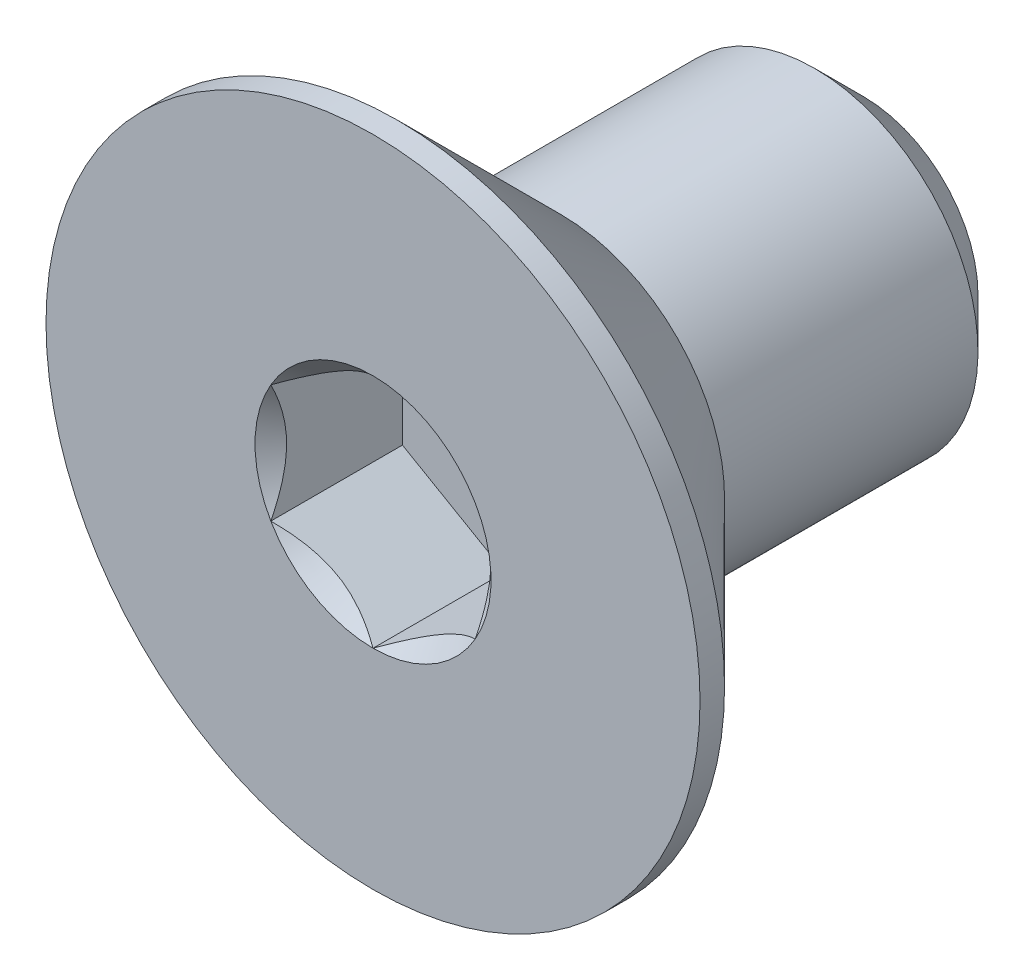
ISO-10303-21;
HEADER;
FILE_DESCRIPTION(('STEP AP214'),'2;1');
FILE_NAME('part.step','',(''),(''),'','','');
FILE_SCHEMA(('AUTOMOTIVE_DESIGN { 1 0 10303 214 1 1 1 1 }'));
ENDSEC;
DATA;
#1=APPLICATION_CONTEXT('core data for automotive mechanical design processes');
#2=APPLICATION_PROTOCOL_DEFINITION('international standard','automotive_design',2000,#1);
#3=PRODUCT_CONTEXT('',#1,'mechanical');
#4=PRODUCT('Part','Part','',(#3));
#5=PRODUCT_RELATED_PRODUCT_CATEGORY('part','',(#4));
#6=PRODUCT_DEFINITION_FORMATION('','',#4);
#7=PRODUCT_DEFINITION_CONTEXT('part definition',#1,'design');
#8=PRODUCT_DEFINITION('design','',#6,#7);
#9=PRODUCT_DEFINITION_SHAPE('','',#8);
#10=(LENGTH_UNIT() NAMED_UNIT(*) SI_UNIT(.MILLI.,.METRE.));
#11=(NAMED_UNIT(*) PLANE_ANGLE_UNIT() SI_UNIT($,.RADIAN.));
#12=(NAMED_UNIT(*) SI_UNIT($,.STERADIAN.) SOLID_ANGLE_UNIT());
#13=UNCERTAINTY_MEASURE_WITH_UNIT(LENGTH_MEASURE(1.E-05),#10,'distance_accuracy_value','');
#14=(GEOMETRIC_REPRESENTATION_CONTEXT(3) GLOBAL_UNCERTAINTY_ASSIGNED_CONTEXT((#13)) GLOBAL_UNIT_ASSIGNED_CONTEXT((#10,
#11,#12)) REPRESENTATION_CONTEXT('',''));
#15=CARTESIAN_POINT('',(0.,0.,0.));
#16=DIRECTION('',(0.,0.,1.));
#17=DIRECTION('',(1.,0.,0.));
#18=AXIS2_PLACEMENT_3D('',#15,#16,#17);
#19=CARTESIAN_POINT('',(0.,0.,-3.));
#20=DIRECTION('',(0.,0.,-1.));
#21=DIRECTION('',(0.,1.,0.));
#22=AXIS2_PLACEMENT_3D('',#19,#20,#21);
#23=CYLINDRICAL_SURFACE('',#22,2.);
#24=CARTESIAN_POINT('',(0.,0.,0.700000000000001));
#25=DIRECTION('',(0.,0.,-1.));
#26=DIRECTION('',(0.,1.,0.));
#27=AXIS2_PLACEMENT_3D('',#24,#25,#26);
#28=CIRCLE('',#27,2.);
#29=CARTESIAN_POINT('',(0.,2.,0.700000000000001));
#30=VERTEX_POINT('',#29);
#31=EDGE_CURVE('E11',#30,#30,#28,.F.);
#32=ORIENTED_EDGE('',*,*,#31,.F.);
#33=EDGE_LOOP('',(#32));
#34=FACE_BOUND('',#33,.T.);
#35=CARTESIAN_POINT('',(0.,0.,-2.4));
#36=DIRECTION('',(0.,0.,-1.));
#37=DIRECTION('',(0.,1.,0.));
#38=AXIS2_PLACEMENT_3D('',#35,#36,#37);
#39=CIRCLE('',#38,2.);
#40=CARTESIAN_POINT('',(0.,2.,-2.4));
#41=VERTEX_POINT('',#40);
#42=EDGE_CURVE('E41',#41,#41,#39,.F.);
#43=ORIENTED_EDGE('',*,*,#42,.T.);
#44=EDGE_LOOP('',(#43));
#45=FACE_BOUND('',#44,.T.);
#46=ADVANCED_FACE('F33',(#34,#45),#23,.T.);
#47=CARTESIAN_POINT('',(0.,2.,-3.));
#48=DIRECTION('',(0.,0.,-1.));
#49=DIRECTION('',(0.,1.,0.));
#50=AXIS2_PLACEMENT_3D('',#47,#48,#49);
#51=PLANE('',#50);
#52=CARTESIAN_POINT('',(0.,0.,-3.));
#53=DIRECTION('',(0.,0.,-1.));
#54=DIRECTION('',(0.,1.,0.));
#55=AXIS2_PLACEMENT_3D('',#52,#53,#54);
#56=CIRCLE('',#55,1.4);
#57=CARTESIAN_POINT('',(0.,1.4,-3.));
#58=VERTEX_POINT('',#57);
#59=EDGE_CURVE('E145',#58,#58,#56,.T.);
#60=ORIENTED_EDGE('',*,*,#59,.T.);
#61=EDGE_LOOP('',(#60));
#62=FACE_BOUND('',#61,.T.);
#63=ADVANCED_FACE('F154',(#62),#51,.T.);
#64=CARTESIAN_POINT('',(0.,0.,-3.));
#65=DIRECTION('',(0.,0.,1.));
#66=DIRECTION('',(0.,-1.,0.));
#67=AXIS2_PLACEMENT_3D('',#64,#65,#66);
#68=CONICAL_SURFACE('',#67,1.4,0.785398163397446);
#69=ORIENTED_EDGE('',*,*,#42,.F.);
#70=EDGE_LOOP('',(#69));
#71=FACE_BOUND('',#70,.T.);
#72=ORIENTED_EDGE('',*,*,#59,.F.);
#73=EDGE_LOOP('',(#72));
#74=FACE_BOUND('',#73,.T.);
#75=ADVANCED_FACE('F35',(#71,#74),#68,.T.);
#76=CARTESIAN_POINT('',(0.,0.,-3.));
#77=DIRECTION('',(0.,0.,-1.));
#78=DIRECTION('',(0.,1.,0.));
#79=AXIS2_PLACEMENT_3D('',#76,#77,#78);
#80=CYLINDRICAL_SURFACE('',#79,4.);
#81=CARTESIAN_POINT('',(0.,0.,3.));
#82=DIRECTION('',(0.,0.,-1.));
#83=DIRECTION('',(0.,1.,0.));
#84=AXIS2_PLACEMENT_3D('',#81,#82,#83);
#85=CIRCLE('',#84,4.);
#86=CARTESIAN_POINT('',(0.,4.,3.));
#87=VERTEX_POINT('',#86);
#88=EDGE_CURVE('E125',#87,#87,#85,.T.);
#89=ORIENTED_EDGE('',*,*,#88,.T.);
#90=EDGE_LOOP('',(#89));
#91=FACE_BOUND('',#90,.T.);
#92=CARTESIAN_POINT('',(0.,0.,2.69999999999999));
#93=DIRECTION('',(0.,0.,-1.));
#94=DIRECTION('',(0.,1.,0.));
#95=AXIS2_PLACEMENT_3D('',#92,#93,#94);
#96=CIRCLE('',#95,4.);
#97=CARTESIAN_POINT('',(0.,4.,2.69999999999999));
#98=VERTEX_POINT('',#97);
#99=EDGE_CURVE('E122',#98,#98,#96,.T.);
#100=ORIENTED_EDGE('',*,*,#99,.F.);
#101=EDGE_LOOP('',(#100));
#102=FACE_BOUND('',#101,.T.);
#103=ADVANCED_FACE('F153',(#91,#102),#80,.T.);
#104=CARTESIAN_POINT('',(0.,0.,0.700000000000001));
#105=DIRECTION('',(0.,0.,1.));
#106=DIRECTION('',(0.,-1.,0.));
#107=AXIS2_PLACEMENT_3D('',#104,#105,#106);
#108=CONICAL_SURFACE('',#107,2.,0.78539816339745);
#109=ORIENTED_EDGE('',*,*,#99,.T.);
#110=EDGE_LOOP('',(#109));
#111=FACE_BOUND('',#110,.T.);
#112=ORIENTED_EDGE('',*,*,#31,.T.);
#113=EDGE_LOOP('',(#112));
#114=FACE_BOUND('',#113,.T.);
#115=ADVANCED_FACE('F167',(#111,#114),#108,.T.);
#116=CARTESIAN_POINT('',(0.,0.,3.));
#117=DIRECTION('',(0.,0.,1.));
#118=DIRECTION('',(0.,-1.,0.));
#119=AXIS2_PLACEMENT_3D('',#116,#117,#118);
#120=PLANE('',#119);
#121=CARTESIAN_POINT('',(0.,0.,3.));
#122=DIRECTION('',(0.,0.,1.));
#123=DIRECTION('',(1.,0.,0.));
#124=AXIS2_PLACEMENT_3D('',#121,#122,#123);
#125=CIRCLE('',#124,1.44337567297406);
#126=CARTESIAN_POINT('',(1.25,0.721687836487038,3.));
#127=VERTEX_POINT('',#126);
#128=CARTESIAN_POINT('',(0.,1.44337567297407,3.));
#129=VERTEX_POINT('',#128);
#130=EDGE_CURVE('E92',#127,#129,#125,.T.);
#131=ORIENTED_EDGE('',*,*,#130,.F.);
#132=CARTESIAN_POINT('',(0.,0.,3.));
#133=DIRECTION('',(0.,0.,1.));
#134=DIRECTION('',(1.,0.,0.));
#135=AXIS2_PLACEMENT_3D('',#132,#133,#134);
#136=CIRCLE('',#135,1.44337567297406);
#137=CARTESIAN_POINT('',(1.24999999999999,-0.721687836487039,3.));
#138=VERTEX_POINT('',#137);
#139=EDGE_CURVE('E104',#138,#127,#136,.T.);
#140=ORIENTED_EDGE('',*,*,#139,.F.);
#141=CARTESIAN_POINT('',(0.,0.,3.));
#142=DIRECTION('',(0.,0.,1.));
#143=DIRECTION('',(1.,0.,0.));
#144=AXIS2_PLACEMENT_3D('',#141,#142,#143);
#145=CIRCLE('',#144,1.44337567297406);
#146=CARTESIAN_POINT('',(0.,-1.44337567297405,3.));
#147=VERTEX_POINT('',#146);
#148=EDGE_CURVE('E238',#147,#138,#145,.T.);
#149=ORIENTED_EDGE('',*,*,#148,.F.);
#150=CARTESIAN_POINT('',(0.,0.,3.));
#151=DIRECTION('',(0.,0.,1.));
#152=DIRECTION('',(1.,0.,0.));
#153=AXIS2_PLACEMENT_3D('',#150,#151,#152);
#154=CIRCLE('',#153,1.44337567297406);
#155=CARTESIAN_POINT('',(-1.25,-0.72168783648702,3.));
#156=VERTEX_POINT('',#155);
#157=EDGE_CURVE('E117',#156,#147,#154,.T.);
#158=ORIENTED_EDGE('',*,*,#157,.F.);
#159=CARTESIAN_POINT('',(0.,0.,3.));
#160=DIRECTION('',(0.,0.,1.));
#161=DIRECTION('',(1.,0.,0.));
#162=AXIS2_PLACEMENT_3D('',#159,#160,#161);
#163=CIRCLE('',#162,1.44337567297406);
#164=CARTESIAN_POINT('',(-1.25,0.72168783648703,3.));
#165=VERTEX_POINT('',#164);
#166=EDGE_CURVE('E239',#165,#156,#163,.T.);
#167=ORIENTED_EDGE('',*,*,#166,.F.);
#168=CARTESIAN_POINT('',(0.,0.,3.));
#169=DIRECTION('',(0.,0.,1.));
#170=DIRECTION('',(1.,0.,0.));
#171=AXIS2_PLACEMENT_3D('',#168,#169,#170);
#172=CIRCLE('',#171,1.44337567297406);
#173=EDGE_CURVE('E107',#129,#165,#172,.T.);
#174=ORIENTED_EDGE('',*,*,#173,.F.);
#175=EDGE_LOOP('',(#131,#140,#149,#158,#167,#174));
#176=FACE_BOUND('',#175,.T.);
#177=ORIENTED_EDGE('',*,*,#88,.F.);
#178=EDGE_LOOP('',(#177));
#179=FACE_BOUND('',#178,.T.);
#180=ADVANCED_FACE('F101',(#176,#179),#120,.T.);
#181=CARTESIAN_POINT('',(1.25,0.721687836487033,1.39));
#182=DIRECTION('',(0.5,0.866025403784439,0.));
#183=DIRECTION('',(-0.866025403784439,0.5,0.));
#184=AXIS2_PLACEMENT_3D('',#181,#182,#183);
#185=PLANE('',#184);
#186=DIRECTION('',(0.,0.,1.));
#187=VECTOR('',#186,1.);
#188=CARTESIAN_POINT('',(1.25,0.721687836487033,1.39));
#189=LINE('',#188,#187);
#190=CARTESIAN_POINT('',(1.25,0.721687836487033,1.39));
#191=VERTEX_POINT('',#190);
#192=EDGE_CURVE('E48',#191,#127,#189,.T.);
#193=ORIENTED_EDGE('',*,*,#192,.T.);
#194=CARTESIAN_POINT('',(-0.000199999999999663,1.4434911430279,3.00011548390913));
#195=CARTESIAN_POINT('',(0.0427751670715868,1.41867941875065,2.9753216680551));
#196=CARTESIAN_POINT('',(0.0864690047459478,1.39345276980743,2.95198373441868));
#197=CARTESIAN_POINT('',(0.175565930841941,1.34201263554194,2.90925200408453));
#198=CARTESIAN_POINT('',(0.220977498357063,1.31579425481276,2.88988199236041));
#199=CARTESIAN_POINT('',(0.312547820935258,1.26292610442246,2.85670048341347));
#200=CARTESIAN_POINT('',(0.358683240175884,1.23628980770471,2.84280555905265));
#201=CARTESIAN_POINT('',(0.45197008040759,1.18243062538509,2.82139728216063));
#202=CARTESIAN_POINT('',(0.499118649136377,1.15520938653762,2.81386794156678));
#203=CARTESIAN_POINT('',(0.580373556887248,1.10829684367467,2.8070744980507));
#204=CARTESIAN_POINT('',(0.614374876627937,1.08866617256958,2.80606855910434));
#205=CARTESIAN_POINT('',(0.682317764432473,1.04943932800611,2.80776141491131));
#206=CARTESIAN_POINT('',(0.716259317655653,1.029843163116,2.81046102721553));
#207=CARTESIAN_POINT('',(0.783814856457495,0.990839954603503,2.81940893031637));
#208=CARTESIAN_POINT('',(0.81742850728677,0.971433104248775,2.8256605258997));
#209=CARTESIAN_POINT('',(0.884094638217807,0.932943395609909,2.8413756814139));
#210=CARTESIAN_POINT('',(0.91714687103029,0.913860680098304,2.85084062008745));
#211=CARTESIAN_POINT('',(1.00179969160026,0.864986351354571,2.87893139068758));
#212=CARTESIAN_POINT('',(1.05286649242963,0.835502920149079,2.8996701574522));
#213=CARTESIAN_POINT('',(1.15300085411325,0.77769031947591,2.94638713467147));
#214=CARTESIAN_POINT('',(1.20207431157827,0.749357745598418,2.97234829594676));
#215=CARTESIAN_POINT('',(1.2502,0.721572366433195,3.00011548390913));
#216=B_SPLINE_CURVE_WITH_KNOTS('',3,(#194,#195,#196,#197,#198,#199,#200,#201,#202,#203,#204,
#205,#206,#207,#208,#209,#210,#211,#212,#213,#214,#215),.UNSPECIFIED.,.F.,.F.,(4,2,2,2,2,2,2,2,
2,2,4),(0.,0.166533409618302,0.334037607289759,0.498880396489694,0.663307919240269,
0.780963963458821,0.898645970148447,1.01643764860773,1.13427993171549,1.3214865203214,
1.50809158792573),.UNSPECIFIED.);
#217=EDGE_CURVE('E89',#129,#127,#216,.T.);
#218=ORIENTED_EDGE('',*,*,#217,.F.);
#219=DIRECTION('',(0.,0.,1.));
#220=VECTOR('',#219,1.);
#221=CARTESIAN_POINT('',(0.,1.44337567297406,1.39));
#222=LINE('',#221,#220);
#223=CARTESIAN_POINT('',(0.,1.44337567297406,1.39));
#224=VERTEX_POINT('',#223);
#225=EDGE_CURVE('E141',#224,#129,#222,.T.);
#226=ORIENTED_EDGE('',*,*,#225,.F.);
#227=DIRECTION('',(-0.866025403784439,0.5,0.));
#228=VECTOR('',#227,1.);
#229=CARTESIAN_POINT('',(1.25,0.721687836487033,1.39));
#230=LINE('',#229,#228);
#231=EDGE_CURVE('E114',#191,#224,#230,.T.);
#232=ORIENTED_EDGE('',*,*,#231,.F.);
#233=EDGE_LOOP('',(#193,#218,#226,#232));
#234=FACE_BOUND('',#233,.T.);
#235=ADVANCED_FACE('F119',(#234),#185,.F.);
#236=CARTESIAN_POINT('',(1.25,-0.721687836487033,1.39));
#237=DIRECTION('',(1.,0.,0.));
#238=DIRECTION('',(0.,1.,0.));
#239=AXIS2_PLACEMENT_3D('',#236,#237,#238);
#240=PLANE('',#239);
#241=DIRECTION('',(0.,0.,1.));
#242=VECTOR('',#241,1.);
#243=CARTESIAN_POINT('',(1.25,-0.721687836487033,1.39));
#244=LINE('',#243,#242);
#245=CARTESIAN_POINT('',(1.25,-0.721687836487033,1.39));
#246=VERTEX_POINT('',#245);
#247=EDGE_CURVE('E56',#246,#138,#244,.T.);
#248=ORIENTED_EDGE('',*,*,#247,.T.);
#249=CARTESIAN_POINT('',(1.25,-1.43934010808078,3.46298209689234));
#250=CARTESIAN_POINT('',(1.25,-1.40429313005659,3.4365249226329));
#251=CARTESIAN_POINT('',(1.25,-1.369050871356,3.41032716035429));
#252=CARTESIAN_POINT('',(1.25,-1.29809650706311,3.3585575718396));
#253=CARTESIAN_POINT('',(1.25,-1.26238428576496,3.33298590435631));
#254=CARTESIAN_POINT('',(1.25,-1.15390111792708,3.25700599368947));
#255=CARTESIAN_POINT('',(1.25,-1.08031646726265,3.20774028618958));
#256=CARTESIAN_POINT('',(1.25,-0.926012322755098,3.11102583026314));
#257=CARTESIAN_POINT('',(1.25,-0.845125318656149,3.0638412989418));
#258=CARTESIAN_POINT('',(1.25,-0.679311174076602,2.97753073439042));
#259=CARTESIAN_POINT('',(1.25,-0.594398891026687,2.9383775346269));
#260=CARTESIAN_POINT('',(1.25,-0.466944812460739,2.8904772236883));
#261=CARTESIAN_POINT('',(1.25,-0.42628998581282,2.87672948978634));
#262=CARTESIAN_POINT('',(1.25,-0.343998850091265,2.85249792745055));
#263=CARTESIAN_POINT('',(1.25,-0.302362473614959,2.84201432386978));
#264=CARTESIAN_POINT('',(1.25,-0.219052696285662,2.8250301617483));
#265=CARTESIAN_POINT('',(1.25,-0.177393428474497,2.81846136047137));
#266=CARTESIAN_POINT('',(1.25,-0.0936293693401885,2.80943505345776));
#267=CARTESIAN_POINT('',(1.25,-0.051524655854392,2.80697684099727));
#268=CARTESIAN_POINT('',(1.25,0.031189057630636,2.80635406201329));
#269=CARTESIAN_POINT('',(1.25,0.0717969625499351,2.80803711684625));
#270=CARTESIAN_POINT('',(1.25,0.152668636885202,2.81526827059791));
#271=CARTESIAN_POINT('',(1.25,0.192932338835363,2.82081711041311));
#272=CARTESIAN_POINT('',(1.25,0.273499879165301,2.83557103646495));
#273=CARTESIAN_POINT('',(1.25,0.313792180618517,2.84483817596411));
#274=CARTESIAN_POINT('',(1.25,0.393496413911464,2.86653617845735));
#275=CARTESIAN_POINT('',(1.25,0.432908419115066,2.87896677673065));
#276=CARTESIAN_POINT('',(1.25,0.556992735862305,2.92277935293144));
#277=CARTESIAN_POINT('',(1.25,0.639898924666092,2.95915107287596));
#278=CARTESIAN_POINT('',(1.25,0.801816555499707,3.04001916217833));
#279=CARTESIAN_POINT('',(1.25,0.88081266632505,3.08454472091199));
#280=CARTESIAN_POINT('',(1.25,1.0317856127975,3.17640487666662));
#281=CARTESIAN_POINT('',(1.25,1.10391618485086,3.22348993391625));
#282=CARTESIAN_POINT('',(1.25,1.21018606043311,3.29627856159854));
#283=CARTESIAN_POINT('',(1.25,1.2451506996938,3.32079808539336));
#284=CARTESIAN_POINT('',(1.25,1.31460220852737,3.37048563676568));
#285=CARTESIAN_POINT('',(1.25,1.34908920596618,3.39565348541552));
#286=CARTESIAN_POINT('',(1.25,1.38337731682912,3.42109014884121));
#287=B_SPLINE_CURVE_WITH_KNOTS('',3,(#249,#250,#251,#252,#253,#254,#255,#256,#257,#258,#259,
#260,#261,#262,#263,#264,#265,#266,#267,#268,#269,#270,#271,#272,#273,#274,#275,#276,#277,#278,
#279,#280,#281,#282,#283,#284,#285,#286),.UNSPECIFIED.,.F.,.F.,(4,2,2,2,2,2,2,2,2,2,2,2,2,2,2,2,
2,2,4),(0.,0.13173296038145,0.263498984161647,0.529042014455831,0.809741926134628,
1.08947609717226,1.21811634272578,1.34676544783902,1.47310084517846,1.59941451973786,
1.72115042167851,1.84290966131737,1.96679153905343,2.09066305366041,2.36146692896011,
2.63325989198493,2.89154668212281,3.01965734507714,3.1477330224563),.UNSPECIFIED.);
#288=EDGE_CURVE('E113',#127,#138,#287,.F.);
#289=ORIENTED_EDGE('',*,*,#288,.F.);
#290=ORIENTED_EDGE('',*,*,#192,.F.);
#291=DIRECTION('',(0.,1.,0.));
#292=VECTOR('',#291,1.);
#293=CARTESIAN_POINT('',(1.25,-0.721687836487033,1.39));
#294=LINE('',#293,#292);
#295=EDGE_CURVE('E130',#246,#191,#294,.T.);
#296=ORIENTED_EDGE('',*,*,#295,.F.);
#297=EDGE_LOOP('',(#248,#289,#290,#296));
#298=FACE_BOUND('',#297,.T.);
#299=ADVANCED_FACE('F116',(#298),#240,.F.);
#300=CARTESIAN_POINT('',(0.,-1.44337567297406,1.39));
#301=DIRECTION('',(0.5,-0.866025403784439,0.));
#302=DIRECTION('',(0.866025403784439,0.5,0.));
#303=AXIS2_PLACEMENT_3D('',#300,#301,#302);
#304=PLANE('',#303);
#305=DIRECTION('',(0.,0.,1.));
#306=VECTOR('',#305,1.);
#307=CARTESIAN_POINT('',(0.,-1.44337567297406,1.39));
#308=LINE('',#307,#306);
#309=CARTESIAN_POINT('',(0.,-1.44337567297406,1.39));
#310=VERTEX_POINT('',#309);
#311=EDGE_CURVE('E127',#310,#147,#308,.T.);
#312=ORIENTED_EDGE('',*,*,#311,.T.);
#313=CARTESIAN_POINT('',(1.2502,-0.721572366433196,3.00011548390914));
#314=CARTESIAN_POINT('',(1.20722483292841,-0.746384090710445,2.97532166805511));
#315=CARTESIAN_POINT('',(1.16353099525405,-0.771610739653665,2.95198373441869));
#316=CARTESIAN_POINT('',(1.07443406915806,-0.823050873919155,2.90925200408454));
#317=CARTESIAN_POINT('',(1.02902250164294,-0.849269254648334,2.88988199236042));
#318=CARTESIAN_POINT('',(0.937452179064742,-0.902137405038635,2.85670048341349));
#319=CARTESIAN_POINT('',(0.891316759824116,-0.928773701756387,2.84280555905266));
#320=CARTESIAN_POINT('',(0.79802991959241,-0.982632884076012,2.82139728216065));
#321=CARTESIAN_POINT('',(0.750881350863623,-1.00985412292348,2.8138679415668));
#322=CARTESIAN_POINT('',(0.669626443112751,-1.05676666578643,2.80707449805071));
#323=CARTESIAN_POINT('',(0.635625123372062,-1.07639733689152,2.80606855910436));
#324=CARTESIAN_POINT('',(0.567682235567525,-1.11562418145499,2.80776141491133));
#325=CARTESIAN_POINT('',(0.533740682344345,-1.1352203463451,2.81046102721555));
#326=CARTESIAN_POINT('',(0.466185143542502,-1.1742235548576,2.81940893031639));
#327=CARTESIAN_POINT('',(0.432571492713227,-1.19363040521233,2.82566052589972));
#328=CARTESIAN_POINT('',(0.365905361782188,-1.23212011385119,2.84137568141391));
#329=CARTESIAN_POINT('',(0.332853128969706,-1.2512028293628,2.85084062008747));
#330=CARTESIAN_POINT('',(0.248200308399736,-1.30007715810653,2.8789313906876));
#331=CARTESIAN_POINT('',(0.197133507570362,-1.32956058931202,2.89967015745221));
#332=CARTESIAN_POINT('',(0.0969991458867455,-1.38737318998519,2.94638713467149));
#333=CARTESIAN_POINT('',(0.0479256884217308,-1.41570576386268,2.97234829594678));
#334=CARTESIAN_POINT('',(-0.000199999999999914,-1.4434911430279,3.00011548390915));
#335=B_SPLINE_CURVE_WITH_KNOTS('',3,(#313,#314,#315,#316,#317,#318,#319,#320,#321,#322,#323,
#324,#325,#326,#327,#328,#329,#330,#331,#332,#333,#334),.UNSPECIFIED.,.F.,.F.,(4,2,2,2,2,2,2,2,
2,2,4),(0.,0.166533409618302,0.334037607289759,0.498880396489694,0.663307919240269,
0.780963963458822,0.898645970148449,1.01643764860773,1.13427993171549,1.32148652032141,
1.50809158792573),.UNSPECIFIED.);
#336=EDGE_CURVE('E236',#138,#147,#335,.T.);
#337=ORIENTED_EDGE('',*,*,#336,.F.);
#338=ORIENTED_EDGE('',*,*,#247,.F.);
#339=DIRECTION('',(0.866025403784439,0.5,0.));
#340=VECTOR('',#339,1.);
#341=CARTESIAN_POINT('',(0.,-1.44337567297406,1.39));
#342=LINE('',#341,#340);
#343=EDGE_CURVE('E228',#310,#246,#342,.T.);
#344=ORIENTED_EDGE('',*,*,#343,.F.);
#345=EDGE_LOOP('',(#312,#337,#338,#344));
#346=FACE_BOUND('',#345,.T.);
#347=ADVANCED_FACE('F192',(#346),#304,.F.);
#348=CARTESIAN_POINT('',(-1.25,-0.721687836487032,1.39));
#349=DIRECTION('',(-0.5,-0.866025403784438,0.));
#350=DIRECTION('',(0.866025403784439,-0.5,0.));
#351=AXIS2_PLACEMENT_3D('',#348,#349,#350);
#352=PLANE('',#351);
#353=DIRECTION('',(0.,0.,1.));
#354=VECTOR('',#353,1.);
#355=CARTESIAN_POINT('',(-1.25,-0.721687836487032,1.39));
#356=LINE('',#355,#354);
#357=CARTESIAN_POINT('',(-1.25,-0.721687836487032,1.39));
#358=VERTEX_POINT('',#357);
#359=EDGE_CURVE('E135',#358,#156,#356,.T.);
#360=ORIENTED_EDGE('',*,*,#359,.T.);
#361=CARTESIAN_POINT('',(0.000199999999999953,-1.4434911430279,3.00011548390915));
#362=CARTESIAN_POINT('',(-0.042775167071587,-1.41867941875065,2.97532166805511));
#363=CARTESIAN_POINT('',(-0.0864690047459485,-1.39345276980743,2.95198373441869));
#364=CARTESIAN_POINT('',(-0.175565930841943,-1.34201263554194,2.90925200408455));
#365=CARTESIAN_POINT('',(-0.220977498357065,-1.31579425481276,2.88988199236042));
#366=CARTESIAN_POINT('',(-0.312547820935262,-1.26292610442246,2.85670048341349));
#367=CARTESIAN_POINT('',(-0.358683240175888,-1.23628980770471,2.84280555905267));
#368=CARTESIAN_POINT('',(-0.451970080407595,-1.18243062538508,2.82139728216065));
#369=CARTESIAN_POINT('',(-0.499118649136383,-1.15520938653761,2.8138679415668));
#370=CARTESIAN_POINT('',(-0.580373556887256,-1.10829684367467,2.80707449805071));
#371=CARTESIAN_POINT('',(-0.614374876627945,-1.08866617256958,2.80606855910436));
#372=CARTESIAN_POINT('',(-0.682317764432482,-1.04943932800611,2.80776141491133));
#373=CARTESIAN_POINT('',(-0.716259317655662,-1.02984316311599,2.81046102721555));
#374=CARTESIAN_POINT('',(-0.783814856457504,-0.990839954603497,2.81940893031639));
#375=CARTESIAN_POINT('',(-0.81742850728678,-0.971433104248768,2.82566052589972));
#376=CARTESIAN_POINT('',(-0.884094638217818,-0.932943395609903,2.84137568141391));
#377=CARTESIAN_POINT('',(-0.917146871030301,-0.913860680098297,2.85084062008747));
#378=CARTESIAN_POINT('',(-1.00179969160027,-0.864986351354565,2.8789313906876));
#379=CARTESIAN_POINT('',(-1.05286649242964,-0.835502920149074,2.89967015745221));
#380=CARTESIAN_POINT('',(-1.15300085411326,-0.777690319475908,2.94638713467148));
#381=CARTESIAN_POINT('',(-1.20207431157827,-0.749357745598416,2.97234829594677));
#382=CARTESIAN_POINT('',(-1.2502,-0.721572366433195,3.00011548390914));
#383=B_SPLINE_CURVE_WITH_KNOTS('',3,(#361,#362,#363,#364,#365,#366,#367,#368,#369,#370,#371,
#372,#373,#374,#375,#376,#377,#378,#379,#380,#381,#382),.UNSPECIFIED.,.F.,.F.,(4,2,2,2,2,2,2,2,
2,2,4),(0.,0.166533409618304,0.334037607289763,0.498880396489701,0.663307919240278,
0.780963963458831,0.898645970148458,1.01643764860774,1.1342799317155,1.32148652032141,
1.50809158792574),.UNSPECIFIED.);
#384=EDGE_CURVE('E210',#147,#156,#383,.T.);
#385=ORIENTED_EDGE('',*,*,#384,.F.);
#386=ORIENTED_EDGE('',*,*,#311,.F.);
#387=DIRECTION('',(0.866025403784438,-0.5,0.));
#388=VECTOR('',#387,1.);
#389=CARTESIAN_POINT('',(-1.25,-0.721687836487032,1.39));
#390=LINE('',#389,#388);
#391=EDGE_CURVE('E226',#358,#310,#390,.T.);
#392=ORIENTED_EDGE('',*,*,#391,.F.);
#393=EDGE_LOOP('',(#360,#385,#386,#392));
#394=FACE_BOUND('',#393,.T.);
#395=ADVANCED_FACE('F188',(#394),#352,.F.);
#396=CARTESIAN_POINT('',(-1.25,0.721687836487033,1.39));
#397=DIRECTION('',(-1.,0.,0.));
#398=DIRECTION('',(0.,0.,1.));
#399=AXIS2_PLACEMENT_3D('',#396,#397,#398);
#400=PLANE('',#399);
#401=DIRECTION('',(0.,0.,1.));
#402=VECTOR('',#401,1.);
#403=CARTESIAN_POINT('',(-1.25,0.721687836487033,1.39));
#404=LINE('',#403,#402);
#405=CARTESIAN_POINT('',(-1.25,0.721687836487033,1.39));
#406=VERTEX_POINT('',#405);
#407=EDGE_CURVE('E138',#406,#165,#404,.T.);
#408=ORIENTED_EDGE('',*,*,#407,.T.);
#409=CARTESIAN_POINT('',(-1.25,-1.43934010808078,3.46298209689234));
#410=CARTESIAN_POINT('',(-1.25,-1.40429313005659,3.4365249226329));
#411=CARTESIAN_POINT('',(-1.25,-1.369050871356,3.41032716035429));
#412=CARTESIAN_POINT('',(-1.25,-1.29809650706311,3.3585575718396));
#413=CARTESIAN_POINT('',(-1.25,-1.26238428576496,3.3329859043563));
#414=CARTESIAN_POINT('',(-1.25,-1.15390111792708,3.25700599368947));
#415=CARTESIAN_POINT('',(-1.25,-1.08031646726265,3.20774028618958));
#416=CARTESIAN_POINT('',(-1.25,-0.926012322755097,3.11102583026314));
#417=CARTESIAN_POINT('',(-1.25,-0.845125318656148,3.0638412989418));
#418=CARTESIAN_POINT('',(-1.25,-0.679311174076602,2.97753073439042));
#419=CARTESIAN_POINT('',(-1.25,-0.594398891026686,2.93837753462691));
#420=CARTESIAN_POINT('',(-1.25,-0.466944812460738,2.8904772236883));
#421=CARTESIAN_POINT('',(-1.25,-0.426289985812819,2.87672948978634));
#422=CARTESIAN_POINT('',(-1.25,-0.343998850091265,2.85249792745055));
#423=CARTESIAN_POINT('',(-1.25,-0.302362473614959,2.84201432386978));
#424=CARTESIAN_POINT('',(-1.25,-0.219052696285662,2.8250301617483));
#425=CARTESIAN_POINT('',(-1.25,-0.177393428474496,2.81846136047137));
#426=CARTESIAN_POINT('',(-1.25,-0.0936293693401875,2.80943505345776));
#427=CARTESIAN_POINT('',(-1.25,-0.0515246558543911,2.80697684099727));
#428=CARTESIAN_POINT('',(-1.25,0.031189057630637,2.80635406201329));
#429=CARTESIAN_POINT('',(-1.25,0.071796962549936,2.80803711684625));
#430=CARTESIAN_POINT('',(-1.25,0.152668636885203,2.81526827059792));
#431=CARTESIAN_POINT('',(-1.25,0.192932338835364,2.82081711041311));
#432=CARTESIAN_POINT('',(-1.25,0.273499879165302,2.83557103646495));
#433=CARTESIAN_POINT('',(-1.25,0.313792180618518,2.84483817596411));
#434=CARTESIAN_POINT('',(-1.25,0.393496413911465,2.86653617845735));
#435=CARTESIAN_POINT('',(-1.25,0.432908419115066,2.87896677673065));
#436=CARTESIAN_POINT('',(-1.25,0.556992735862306,2.92277935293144));
#437=CARTESIAN_POINT('',(-1.25,0.639898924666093,2.95915107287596));
#438=CARTESIAN_POINT('',(-1.25,0.801816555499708,3.04001916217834));
#439=CARTESIAN_POINT('',(-1.25,0.880812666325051,3.08454472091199));
#440=CARTESIAN_POINT('',(-1.25,1.03178561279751,3.17640487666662));
#441=CARTESIAN_POINT('',(-1.25,1.10391618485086,3.22348993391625));
#442=CARTESIAN_POINT('',(-1.25,1.21018606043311,3.29627856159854));
#443=CARTESIAN_POINT('',(-1.25,1.2451506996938,3.32079808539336));
#444=CARTESIAN_POINT('',(-1.25,1.31460220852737,3.37048563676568));
#445=CARTESIAN_POINT('',(-1.25,1.34908920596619,3.39565348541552));
#446=CARTESIAN_POINT('',(-1.25,1.38337731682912,3.42109014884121));
#447=B_SPLINE_CURVE_WITH_KNOTS('',3,(#409,#410,#411,#412,#413,#414,#415,#416,#417,#418,#419,
#420,#421,#422,#423,#424,#425,#426,#427,#428,#429,#430,#431,#432,#433,#434,#435,#436,#437,#438,
#439,#440,#441,#442,#443,#444,#445,#446),.UNSPECIFIED.,.F.,.F.,(4,2,2,2,2,2,2,2,2,2,2,2,2,2,2,2,
2,2,4),(0.,0.13173296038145,0.263498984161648,0.529042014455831,0.809741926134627,
1.08947609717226,1.21811634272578,1.34676544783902,1.47310084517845,1.59941451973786,
1.72115042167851,1.84290966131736,1.96679153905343,2.09066305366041,2.36146692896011,
2.63325989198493,2.89154668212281,3.01965734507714,3.1477330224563),.UNSPECIFIED.);
#448=EDGE_CURVE('E95',#156,#165,#447,.T.);
#449=ORIENTED_EDGE('',*,*,#448,.F.);
#450=ORIENTED_EDGE('',*,*,#359,.F.);
#451=DIRECTION('',(0.,-1.,0.));
#452=VECTOR('',#451,1.);
#453=CARTESIAN_POINT('',(-1.25,0.721687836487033,1.39));
#454=LINE('',#453,#452);
#455=EDGE_CURVE('E223',#406,#358,#454,.T.);
#456=ORIENTED_EDGE('',*,*,#455,.F.);
#457=EDGE_LOOP('',(#408,#449,#450,#456));
#458=FACE_BOUND('',#457,.T.);
#459=ADVANCED_FACE('F184',(#458),#400,.F.);
#460=CARTESIAN_POINT('',(0.,1.44337567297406,1.39));
#461=DIRECTION('',(-0.5,0.866025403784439,0.));
#462=DIRECTION('',(-0.866025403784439,-0.5,0.));
#463=AXIS2_PLACEMENT_3D('',#460,#461,#462);
#464=PLANE('',#463);
#465=ORIENTED_EDGE('',*,*,#225,.T.);
#466=CARTESIAN_POINT('',(-1.2502,0.721572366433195,3.00011548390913));
#467=CARTESIAN_POINT('',(-1.20722483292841,0.746384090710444,2.9753216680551));
#468=CARTESIAN_POINT('',(-1.16353099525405,0.771610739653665,2.95198373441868));
#469=CARTESIAN_POINT('',(-1.07443406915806,0.823050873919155,2.90925200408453));
#470=CARTESIAN_POINT('',(-1.02902250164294,0.849269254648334,2.88988199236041));
#471=CARTESIAN_POINT('',(-0.937452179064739,0.902137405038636,2.85670048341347));
#472=CARTESIAN_POINT('',(-0.891316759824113,0.928773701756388,2.84280555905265));
#473=CARTESIAN_POINT('',(-0.798029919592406,0.982632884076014,2.82139728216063));
#474=CARTESIAN_POINT('',(-0.750881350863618,1.00985412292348,2.81386794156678));
#475=CARTESIAN_POINT('',(-0.669626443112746,1.05676666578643,2.8070744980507));
#476=CARTESIAN_POINT('',(-0.635625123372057,1.07639733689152,2.80606855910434));
#477=CARTESIAN_POINT('',(-0.567682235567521,1.11562418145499,2.80776141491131));
#478=CARTESIAN_POINT('',(-0.533740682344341,1.1352203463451,2.81046102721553));
#479=CARTESIAN_POINT('',(-0.4661851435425,1.1742235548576,2.81940893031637));
#480=CARTESIAN_POINT('',(-0.432571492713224,1.19363040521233,2.8256605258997));
#481=CARTESIAN_POINT('',(-0.365905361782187,1.23212011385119,2.8413756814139));
#482=CARTESIAN_POINT('',(-0.332853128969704,1.2512028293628,2.85084062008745));
#483=CARTESIAN_POINT('',(-0.248200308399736,1.30007715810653,2.87893139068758));
#484=CARTESIAN_POINT('',(-0.197133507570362,1.32956058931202,2.89967015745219));
#485=CARTESIAN_POINT('',(-0.0969991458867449,1.38737318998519,2.94638713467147));
#486=CARTESIAN_POINT('',(-0.0479256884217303,1.41570576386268,2.97234829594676));
#487=CARTESIAN_POINT('',(0.000200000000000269,1.4434911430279,3.00011548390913));
#488=B_SPLINE_CURVE_WITH_KNOTS('',3,(#466,#467,#468,#469,#470,#471,#472,#473,#474,#475,#476,
#477,#478,#479,#480,#481,#482,#483,#484,#485,#486,#487),.UNSPECIFIED.,.F.,.F.,(4,2,2,2,2,2,2,2,
2,2,4),(0.,0.166533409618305,0.334037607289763,0.4988803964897,0.663307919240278,
0.780963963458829,0.898645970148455,1.01643764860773,1.1342799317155,1.32148652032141,
1.50809158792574),.UNSPECIFIED.);
#489=EDGE_CURVE('E232',#165,#129,#488,.T.);
#490=ORIENTED_EDGE('',*,*,#489,.F.);
#491=ORIENTED_EDGE('',*,*,#407,.F.);
#492=DIRECTION('',(-0.866025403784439,-0.5,0.));
#493=VECTOR('',#492,1.);
#494=CARTESIAN_POINT('',(0.,1.44337567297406,1.39));
#495=LINE('',#494,#493);
#496=EDGE_CURVE('E220',#224,#406,#495,.T.);
#497=ORIENTED_EDGE('',*,*,#496,.F.);
#498=EDGE_LOOP('',(#465,#490,#491,#497));
#499=FACE_BOUND('',#498,.T.);
#500=ADVANCED_FACE('F180',(#499),#464,.F.);
#501=CARTESIAN_POINT('',(0.,0.,1.39));
#502=DIRECTION('',(0.,0.,1.));
#503=DIRECTION('',(1.,0.,0.));
#504=AXIS2_PLACEMENT_3D('',#501,#502,#503);
#505=PLANE('',#504);
#506=ORIENTED_EDGE('',*,*,#231,.T.);
#507=ORIENTED_EDGE('',*,*,#496,.T.);
#508=ORIENTED_EDGE('',*,*,#455,.T.);
#509=ORIENTED_EDGE('',*,*,#391,.T.);
#510=ORIENTED_EDGE('',*,*,#343,.T.);
#511=ORIENTED_EDGE('',*,*,#295,.T.);
#512=EDGE_LOOP('',(#506,#507,#508,#509,#510,#511));
#513=FACE_BOUND('',#512,.T.);
#514=ADVANCED_FACE('F183',(#513),#505,.T.);
#515=CARTESIAN_POINT('',(0.,0.,3.));
#516=DIRECTION('',(0.,0.,1.));
#517=DIRECTION('',(1.,0.,0.));
#518=AXIS2_PLACEMENT_3D('',#515,#516,#517);
#519=CONICAL_SURFACE('',#518,1.44337567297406,0.78539816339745);
#520=ORIENTED_EDGE('',*,*,#489,.T.);
#521=ORIENTED_EDGE('',*,*,#173,.T.);
#522=EDGE_LOOP('',(#520,#521));
#523=FACE_BOUND('',#522,.T.);
#524=ADVANCED_FACE('F200',(#523),#519,.F.);
#525=CARTESIAN_POINT('',(0.,0.,3.));
#526=DIRECTION('',(0.,0.,1.));
#527=DIRECTION('',(1.,0.,0.));
#528=AXIS2_PLACEMENT_3D('',#525,#526,#527);
#529=CONICAL_SURFACE('',#528,1.44337567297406,0.78539816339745);
#530=ORIENTED_EDGE('',*,*,#384,.T.);
#531=ORIENTED_EDGE('',*,*,#157,.T.);
#532=EDGE_LOOP('',(#530,#531));
#533=FACE_BOUND('',#532,.T.);
#534=ADVANCED_FACE('F202',(#533),#529,.F.);
#535=CARTESIAN_POINT('',(0.,0.,3.));
#536=DIRECTION('',(0.,0.,1.));
#537=DIRECTION('',(1.,0.,0.));
#538=AXIS2_PLACEMENT_3D('',#535,#536,#537);
#539=CONICAL_SURFACE('',#538,1.44337567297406,0.78539816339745);
#540=ORIENTED_EDGE('',*,*,#288,.T.);
#541=ORIENTED_EDGE('',*,*,#139,.T.);
#542=EDGE_LOOP('',(#540,#541));
#543=FACE_BOUND('',#542,.T.);
#544=ADVANCED_FACE('F112',(#543),#539,.F.);
#545=CARTESIAN_POINT('',(0.,0.,3.));
#546=DIRECTION('',(0.,0.,1.));
#547=DIRECTION('',(1.,0.,0.));
#548=AXIS2_PLACEMENT_3D('',#545,#546,#547);
#549=CONICAL_SURFACE('',#548,1.44337567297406,0.78539816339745);
#550=ORIENTED_EDGE('',*,*,#336,.T.);
#551=ORIENTED_EDGE('',*,*,#148,.T.);
#552=EDGE_LOOP('',(#550,#551));
#553=FACE_BOUND('',#552,.T.);
#554=ADVANCED_FACE('F251',(#553),#549,.F.);
#555=CARTESIAN_POINT('',(0.,0.,3.));
#556=DIRECTION('',(0.,0.,1.));
#557=DIRECTION('',(1.,0.,0.));
#558=AXIS2_PLACEMENT_3D('',#555,#556,#557);
#559=CONICAL_SURFACE('',#558,1.44337567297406,0.78539816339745);
#560=ORIENTED_EDGE('',*,*,#448,.T.);
#561=ORIENTED_EDGE('',*,*,#166,.T.);
#562=EDGE_LOOP('',(#560,#561));
#563=FACE_BOUND('',#562,.T.);
#564=ADVANCED_FACE('F256',(#563),#559,.F.);
#565=CARTESIAN_POINT('',(0.,0.,3.));
#566=DIRECTION('',(0.,0.,1.));
#567=DIRECTION('',(1.,0.,0.));
#568=AXIS2_PLACEMENT_3D('',#565,#566,#567);
#569=CONICAL_SURFACE('',#568,1.44337567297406,0.78539816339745);
#570=ORIENTED_EDGE('',*,*,#217,.T.);
#571=ORIENTED_EDGE('',*,*,#130,.T.);
#572=EDGE_LOOP('',(#570,#571));
#573=FACE_BOUND('',#572,.T.);
#574=ADVANCED_FACE('F91',(#573),#569,.F.);
#575=CLOSED_SHELL('',(#46,#63,#75,#103,#115,#180,#235,#299,#347,#395,#459,#500,#514,#524,#534,
#544,#554,#564,#574));
#576=MANIFOLD_SOLID_BREP('B2',#575);
#577=ADVANCED_BREP_SHAPE_REPRESENTATION('',(#18,#576),#14);
#578=SHAPE_DEFINITION_REPRESENTATION(#9,#577);
ENDSEC;
END-ISO-10303-21;
